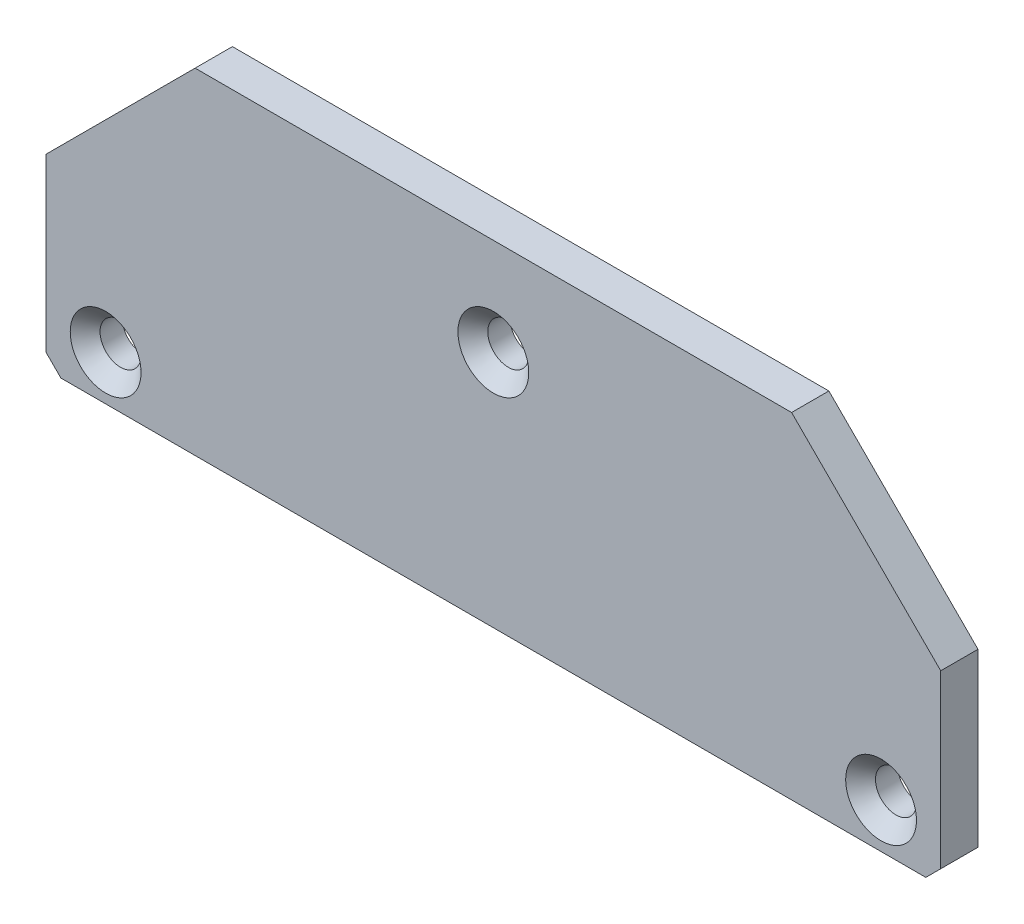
from build123d import *

# Parameters (mm, degrees)
ESQUISSE1_R        = 2.75
BOSS_EXTRU_1_DEPTH = 5
CHANFREIN1_SIZE    = 2
CHANFREIN2_SIZE    = 2


with BuildPart() as part:
    # Esquisse1 → Boss.-Extru.1 (new body)
    with BuildSketch(Plane(origin=(0, 0, -2), x_dir=(-1, 0, 0), z_dir=(0, 0, -1))):
        Polygon((-60, 37.933239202), (-40, 57.933239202), (40, 57.933239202), (60, 37.933239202), (60, 12.933239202), (-60, 12.933239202), align=None)
        with Locations((-52, 18.933239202)):
            Circle(ESQUISSE1_R, mode=Mode.SUBTRACT)
        with Locations((52, 18.933239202)):
            Circle(ESQUISSE1_R, mode=Mode.SUBTRACT)
        with Locations((0, 44.933239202)):
            Circle(ESQUISSE1_R, mode=Mode.SUBTRACT)
    extrude(amount=BOSS_EXTRU_1_DEPTH)

    # Chanfrein1
    chanfrein1_edges = [part.edges().sort_by_distance(p)[0] for p in [
        (54.75, 18.933239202, -2),
        (-49.25, 18.933239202, -2),
        (2.75, 44.933239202, -2),
    ]]
    chamfer(chanfrein1_edges, length=CHANFREIN1_SIZE)

    # Chanfrein2
    chanfrein2_edges = [part.edges().sort_by_distance(p)[0] for p in [
        (-60, 12.933239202, -4.5),
        (60, 12.933239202, -4.5),
    ]]
    chamfer(chanfrein2_edges, length=CHANFREIN2_SIZE)


solid = part.part
